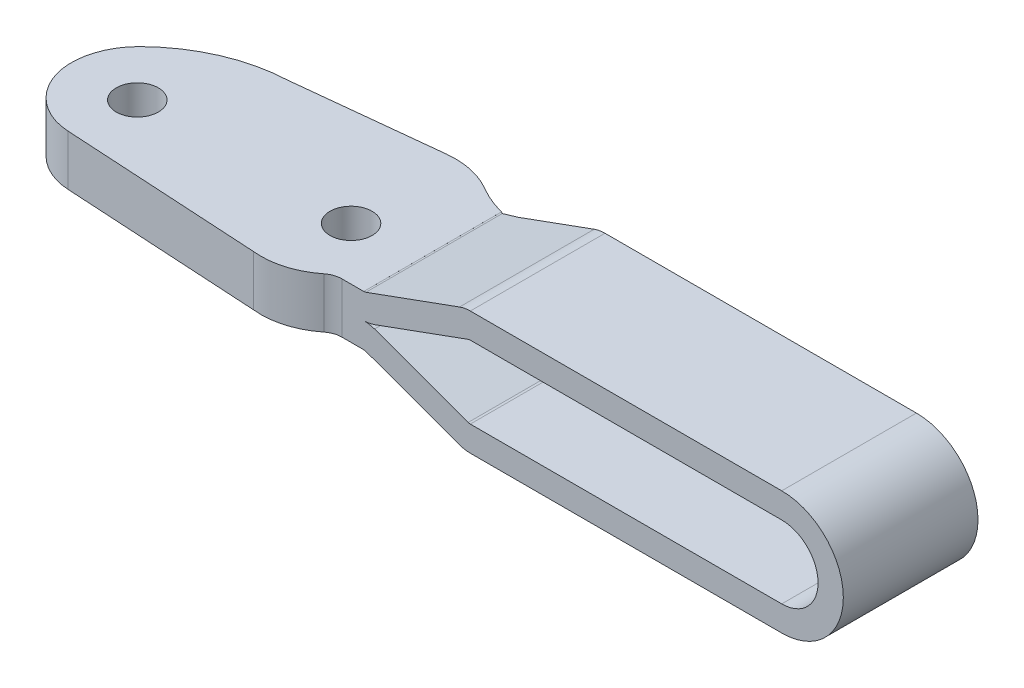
ISO-10303-21;
HEADER;
FILE_DESCRIPTION(('STEP AP214'),'2;1');
FILE_NAME('part.step','',(''),(''),'','','');
FILE_SCHEMA(('AUTOMOTIVE_DESIGN { 1 0 10303 214 1 1 1 1 }'));
ENDSEC;
DATA;
#1=APPLICATION_CONTEXT('core data for automotive mechanical design processes');
#2=APPLICATION_PROTOCOL_DEFINITION('international standard','automotive_design',2000,#1);
#3=PRODUCT_CONTEXT('',#1,'mechanical');
#4=PRODUCT('Part','Part','',(#3));
#5=PRODUCT_RELATED_PRODUCT_CATEGORY('part','',(#4));
#6=PRODUCT_DEFINITION_FORMATION('','',#4);
#7=PRODUCT_DEFINITION_CONTEXT('part definition',#1,'design');
#8=PRODUCT_DEFINITION('design','',#6,#7);
#9=PRODUCT_DEFINITION_SHAPE('','',#8);
#10=(LENGTH_UNIT() NAMED_UNIT(*) SI_UNIT(.MILLI.,.METRE.));
#11=(NAMED_UNIT(*) PLANE_ANGLE_UNIT() SI_UNIT($,.RADIAN.));
#12=(NAMED_UNIT(*) SI_UNIT($,.STERADIAN.) SOLID_ANGLE_UNIT());
#13=UNCERTAINTY_MEASURE_WITH_UNIT(LENGTH_MEASURE(1.E-05),#10,'distance_accuracy_value','');
#14=(GEOMETRIC_REPRESENTATION_CONTEXT(3) GLOBAL_UNCERTAINTY_ASSIGNED_CONTEXT((#13)) GLOBAL_UNIT_ASSIGNED_CONTEXT((#10,
#11,#12)) REPRESENTATION_CONTEXT('',''));
#15=CARTESIAN_POINT('',(0.,0.,0.));
#16=DIRECTION('',(0.,0.,1.));
#17=DIRECTION('',(1.,0.,0.));
#18=AXIS2_PLACEMENT_3D('',#15,#16,#17);
#19=CARTESIAN_POINT('',(33.1604534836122,-3.73599999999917,-15.));
#20=DIRECTION('',(0.,0.,1.));
#21=DIRECTION('',(1.,0.,0.));
#22=AXIS2_PLACEMENT_3D('',#19,#20,#21);
#23=CYLINDRICAL_SURFACE('',#22,3.74);
#24=CARTESIAN_POINT('',(33.1604534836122,-3.73599999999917,-10.120413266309));
#25=DIRECTION('',(0.553809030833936,0.,-0.832643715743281));
#26=DIRECTION('',(0.832643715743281,0.,0.553809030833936));
#27=AXIS2_PLACEMENT_3D('',#24,#25,#26);
#28=ELLIPSE('',#27,4.4917170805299,3.74);
#29=CARTESIAN_POINT('',(33.282729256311,0.00200062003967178,-10.0390850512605));
#30=VERTEX_POINT('',#29);
#31=CARTESIAN_POINT('',(33.4135104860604,-0.00457103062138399,-9.95209967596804));
#32=VERTEX_POINT('',#31);
#33=EDGE_CURVE('E24',#30,#32,#28,.T.);
#34=ORIENTED_EDGE('',*,*,#33,.F.);
#35=DIRECTION('',(0.,0.,1.));
#36=VECTOR('',#35,1.);
#37=CARTESIAN_POINT('',(33.282729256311,0.00200062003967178,-15.));
#38=LINE('',#37,#36);
#39=CARTESIAN_POINT('',(33.282729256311,0.00200062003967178,6.25079999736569));
#40=VERTEX_POINT('',#39);
#41=EDGE_CURVE('E370',#30,#40,#38,.T.);
#42=ORIENTED_EDGE('',*,*,#41,.T.);
#43=CARTESIAN_POINT('',(33.1604534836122,-3.73599999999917,6.25079999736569));
#44=DIRECTION('',(0.,0.,1.));
#45=DIRECTION('',(1.,0.,0.));
#46=AXIS2_PLACEMENT_3D('',#43,#44,#45);
#47=CIRCLE('',#46,3.74);
#48=CARTESIAN_POINT('',(34.4396088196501,-0.221549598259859,6.25079999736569));
#49=VERTEX_POINT('',#48);
#50=EDGE_CURVE('E400',#49,#40,#47,.T.);
#51=ORIENTED_EDGE('',*,*,#50,.F.);
#52=DIRECTION('',(0.,0.,1.));
#53=VECTOR('',#52,1.);
#54=CARTESIAN_POINT('',(34.4396088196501,-0.221549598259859,-15.));
#55=LINE('',#54,#53);
#56=CARTESIAN_POINT('',(34.4396088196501,-0.221549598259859,-9.85360277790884));
#57=VERTEX_POINT('',#56);
#58=EDGE_CURVE('E393',#57,#49,#55,.T.);
#59=ORIENTED_EDGE('',*,*,#58,.F.);
#60=CARTESIAN_POINT('',(33.1604534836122,-3.73599999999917,-9.9763910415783));
#61=DIRECTION('',(0.0955524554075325,0.,-0.995424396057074));
#62=DIRECTION('',(0.995424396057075,0.,0.0955524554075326));
#63=AXIS2_PLACEMENT_3D('',#60,#61,#62);
#64=ELLIPSE('',#63,3.75719141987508,3.74);
#65=EDGE_CURVE('E411',#32,#57,#64,.T.);
#66=ORIENTED_EDGE('',*,*,#65,.F.);
#67=EDGE_LOOP('',(#34,#42,#51,#59,#66));
#68=FACE_BOUND('',#67,.T.);
#69=ADVANCED_FACE('F14',(#68),#23,.T.);
#70=CARTESIAN_POINT('',(34.4396088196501,-0.221549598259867,-15.));
#71=DIRECTION('',(-0.342020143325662,-0.939692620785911,0.));
#72=DIRECTION('',(0.939692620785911,-0.342020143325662,0.));
#73=AXIS2_PLACEMENT_3D('',#70,#71,#72);
#74=PLANE('',#73);
#75=DIRECTION('',(0.93589287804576,-0.340637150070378,0.0898379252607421));
#76=VECTOR('',#75,1.);
#77=CARTESIAN_POINT('',(34.0069065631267,-0.0640588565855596,-9.89513859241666));
#78=LINE('',#77,#76);
#79=CARTESIAN_POINT('',(35.5063968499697,-0.609828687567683,-9.75120000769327));
#80=VERTEX_POINT('',#79);
#81=EDGE_CURVE('E456',#57,#80,#78,.T.);
#82=ORIENTED_EDGE('',*,*,#81,.F.);
#83=ORIENTED_EDGE('',*,*,#58,.T.);
#84=DIRECTION('',(-0.939692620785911,0.342020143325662,0.));
#85=VECTOR('',#84,1.);
#86=CARTESIAN_POINT('',(34.4396088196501,-0.221549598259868,6.25079999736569));
#87=LINE('',#86,#85);
#88=CARTESIAN_POINT('',(45.566405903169,-4.27137253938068,6.25079999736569));
#89=VERTEX_POINT('',#88);
#90=EDGE_CURVE('E310',#89,#49,#87,.T.);
#91=ORIENTED_EDGE('',*,*,#90,.F.);
#92=DIRECTION('',(0.,0.,1.));
#93=VECTOR('',#92,1.);
#94=CARTESIAN_POINT('',(45.566405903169,-4.27137253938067,-15.));
#95=LINE('',#94,#93);
#96=CARTESIAN_POINT('',(45.566405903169,-4.27137253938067,-9.75120000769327));
#97=VERTEX_POINT('',#96);
#98=EDGE_CURVE('E390',#97,#89,#95,.T.);
#99=ORIENTED_EDGE('',*,*,#98,.F.);
#100=DIRECTION('',(0.939692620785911,-0.342020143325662,0.));
#101=VECTOR('',#100,1.);
#102=CARTESIAN_POINT('',(34.4396088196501,-0.221549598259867,-9.75120000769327));
#103=LINE('',#102,#101);
#104=EDGE_CURVE('E9',#80,#97,#103,.T.);
#105=ORIENTED_EDGE('',*,*,#104,.F.);
#106=EDGE_LOOP('',(#82,#83,#91,#99,#105));
#107=FACE_BOUND('',#106,.T.);
#108=ADVANCED_FACE('F542',(#107),#74,.F.);
#109=CARTESIAN_POINT('',(45.81950080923,-3.57599999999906,-15.));
#110=DIRECTION('',(0.,0.,1.));
#111=DIRECTION('',(1.,0.,0.));
#112=AXIS2_PLACEMENT_3D('',#109,#110,#111);
#113=CYLINDRICAL_SURFACE('',#112,0.740000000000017);
#114=CARTESIAN_POINT('',(45.81950080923,-3.57599999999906,-9.75120000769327));
#115=DIRECTION('',(0.,0.,-1.));
#116=DIRECTION('',(-1.,0.,0.));
#117=AXIS2_PLACEMENT_3D('',#114,#115,#116);
#118=CIRCLE('',#117,0.740000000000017);
#119=CARTESIAN_POINT('',(45.81950080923,-4.31599999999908,-9.75120000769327));
#120=VERTEX_POINT('',#119);
#121=EDGE_CURVE('E335',#97,#120,#118,.F.);
#122=ORIENTED_EDGE('',*,*,#121,.F.);
#123=ORIENTED_EDGE('',*,*,#98,.T.);
#124=CARTESIAN_POINT('',(45.81950080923,-3.57599999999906,6.25079999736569));
#125=DIRECTION('',(0.,0.,1.));
#126=DIRECTION('',(1.,0.,0.));
#127=AXIS2_PLACEMENT_3D('',#124,#125,#126);
#128=CIRCLE('',#127,0.740000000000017);
#129=CARTESIAN_POINT('',(45.81950080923,-4.31599999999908,6.25079999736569));
#130=VERTEX_POINT('',#129);
#131=EDGE_CURVE('E496',#130,#89,#128,.F.);
#132=ORIENTED_EDGE('',*,*,#131,.F.);
#133=DIRECTION('',(0.,0.,1.));
#134=VECTOR('',#133,1.);
#135=CARTESIAN_POINT('',(45.81950080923,-4.31599999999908,-15.));
#136=LINE('',#135,#134);
#137=EDGE_CURVE('E387',#120,#130,#136,.T.);
#138=ORIENTED_EDGE('',*,*,#137,.F.);
#139=EDGE_LOOP('',(#122,#123,#132,#138));
#140=FACE_BOUND('',#139,.T.);
#141=ADVANCED_FACE('F582',(#140),#113,.F.);
#142=CARTESIAN_POINT('',(45.81950080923,-4.31599999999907,-15.));
#143=DIRECTION('',(0.,-1.,0.));
#144=DIRECTION('',(1.,0.,0.));
#145=AXIS2_PLACEMENT_3D('',#142,#143,#144);
#146=PLANE('',#145);
#147=DIRECTION('',(1.,0.,0.));
#148=VECTOR('',#147,1.);
#149=CARTESIAN_POINT('',(45.81950080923,-4.31599999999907,-9.75120000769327));
#150=LINE('',#149,#148);
#151=CARTESIAN_POINT('',(82.8214948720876,-4.31599999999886,-9.75120000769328));
#152=VERTEX_POINT('',#151);
#153=EDGE_CURVE('E339',#120,#152,#150,.T.);
#154=ORIENTED_EDGE('',*,*,#153,.F.);
#155=ORIENTED_EDGE('',*,*,#137,.T.);
#156=DIRECTION('',(-1.,0.,0.));
#157=VECTOR('',#156,1.);
#158=CARTESIAN_POINT('',(45.81950080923,-4.31599999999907,6.25079999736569));
#159=LINE('',#158,#157);
#160=CARTESIAN_POINT('',(82.8214948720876,-4.31599999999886,6.25079999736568));
#161=VERTEX_POINT('',#160);
#162=EDGE_CURVE('E498',#161,#130,#159,.T.);
#163=ORIENTED_EDGE('',*,*,#162,.F.);
#164=DIRECTION('',(0.,0.,1.));
#165=VECTOR('',#164,1.);
#166=CARTESIAN_POINT('',(82.8214948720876,-4.31599999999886,-15.));
#167=LINE('',#166,#165);
#168=EDGE_CURVE('E384',#152,#161,#167,.T.);
#169=ORIENTED_EDGE('',*,*,#168,.F.);
#170=EDGE_LOOP('',(#154,#155,#163,#169));
#171=FACE_BOUND('',#170,.T.);
#172=ADVANCED_FACE('F577',(#171),#146,.F.);
#173=CARTESIAN_POINT('',(82.8214948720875,0.00200000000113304,-15.));
#174=DIRECTION('',(0.,0.,1.));
#175=DIRECTION('',(1.,0.,0.));
#176=AXIS2_PLACEMENT_3D('',#173,#174,#175);
#177=CYLINDRICAL_SURFACE('',#176,4.318);
#178=CARTESIAN_POINT('',(82.8214948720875,0.00200000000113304,-9.75120000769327));
#179=DIRECTION('',(0.,0.,-1.));
#180=DIRECTION('',(-1.,0.,0.));
#181=AXIS2_PLACEMENT_3D('',#178,#179,#180);
#182=CIRCLE('',#181,4.318);
#183=CARTESIAN_POINT('',(82.8214948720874,4.32000000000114,-9.75120000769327));
#184=VERTEX_POINT('',#183);
#185=EDGE_CURVE('E341',#152,#184,#182,.F.);
#186=ORIENTED_EDGE('',*,*,#185,.F.);
#187=ORIENTED_EDGE('',*,*,#168,.T.);
#188=CARTESIAN_POINT('',(82.8214948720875,0.00200000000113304,6.25079999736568));
#189=DIRECTION('',(0.,0.,1.));
#190=DIRECTION('',(1.,0.,0.));
#191=AXIS2_PLACEMENT_3D('',#188,#189,#190);
#192=CIRCLE('',#191,4.318);
#193=CARTESIAN_POINT('',(82.8214948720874,4.32000000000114,6.25079999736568));
#194=VERTEX_POINT('',#193);
#195=EDGE_CURVE('E500',#194,#161,#192,.F.);
#196=ORIENTED_EDGE('',*,*,#195,.F.);
#197=DIRECTION('',(0.,0.,1.));
#198=VECTOR('',#197,1.);
#199=CARTESIAN_POINT('',(82.8214948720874,4.32000000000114,-15.));
#200=LINE('',#199,#198);
#201=EDGE_CURVE('E381',#184,#194,#200,.T.);
#202=ORIENTED_EDGE('',*,*,#201,.F.);
#203=EDGE_LOOP('',(#186,#187,#196,#202));
#204=FACE_BOUND('',#203,.T.);
#205=ADVANCED_FACE('F573',(#204),#177,.F.);
#206=CARTESIAN_POINT('',(82.8214948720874,4.32000000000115,-15.));
#207=DIRECTION('',(0.,1.,0.));
#208=DIRECTION('',(-1.,0.,0.));
#209=AXIS2_PLACEMENT_3D('',#206,#207,#208);
#210=PLANE('',#209);
#211=DIRECTION('',(-1.,0.,0.));
#212=VECTOR('',#211,1.);
#213=CARTESIAN_POINT('',(82.8214948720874,4.32000000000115,-9.75120000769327));
#214=LINE('',#213,#212);
#215=CARTESIAN_POINT('',(45.8194629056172,4.32000000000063,-9.75120000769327));
#216=VERTEX_POINT('',#215);
#217=EDGE_CURVE('E343',#184,#216,#214,.T.);
#218=ORIENTED_EDGE('',*,*,#217,.F.);
#219=ORIENTED_EDGE('',*,*,#201,.T.);
#220=DIRECTION('',(1.,0.,0.));
#221=VECTOR('',#220,1.);
#222=CARTESIAN_POINT('',(82.8214948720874,4.32000000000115,6.25079999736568));
#223=LINE('',#222,#221);
#224=CARTESIAN_POINT('',(45.8194629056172,4.32000000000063,6.25079999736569));
#225=VERTEX_POINT('',#224);
#226=EDGE_CURVE('E502',#225,#194,#223,.T.);
#227=ORIENTED_EDGE('',*,*,#226,.F.);
#228=DIRECTION('',(0.,0.,1.));
#229=VECTOR('',#228,1.);
#230=CARTESIAN_POINT('',(45.8194629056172,4.32000000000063,-15.));
#231=LINE('',#230,#229);
#232=EDGE_CURVE('E378',#216,#225,#231,.T.);
#233=ORIENTED_EDGE('',*,*,#232,.F.);
#234=EDGE_LOOP('',(#218,#219,#227,#233));
#235=FACE_BOUND('',#234,.T.);
#236=ADVANCED_FACE('F567',(#235),#210,.F.);
#237=CARTESIAN_POINT('',(45.8194629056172,3.58000000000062,-15.));
#238=DIRECTION('',(0.,0.,1.));
#239=DIRECTION('',(1.,0.,0.));
#240=AXIS2_PLACEMENT_3D('',#237,#238,#239);
#241=CYLINDRICAL_SURFACE('',#240,0.739999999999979);
#242=CARTESIAN_POINT('',(45.8194629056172,3.58000000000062,-9.75120000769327));
#243=DIRECTION('',(0.,0.,-1.));
#244=DIRECTION('',(-1.,0.,0.));
#245=AXIS2_PLACEMENT_3D('',#242,#243,#244);
#246=CIRCLE('',#245,0.739999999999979);
#247=CARTESIAN_POINT('',(45.5663679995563,4.27537253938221,-9.75120000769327));
#248=VERTEX_POINT('',#247);
#249=EDGE_CURVE('E345',#216,#248,#246,.F.);
#250=ORIENTED_EDGE('',*,*,#249,.F.);
#251=ORIENTED_EDGE('',*,*,#232,.T.);
#252=CARTESIAN_POINT('',(45.8194629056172,3.58000000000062,6.25079999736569));
#253=DIRECTION('',(0.,0.,1.));
#254=DIRECTION('',(1.,0.,0.));
#255=AXIS2_PLACEMENT_3D('',#252,#253,#254);
#256=CIRCLE('',#255,0.739999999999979);
#257=CARTESIAN_POINT('',(45.5663679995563,4.27537253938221,6.25079999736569));
#258=VERTEX_POINT('',#257);
#259=EDGE_CURVE('E504',#258,#225,#256,.F.);
#260=ORIENTED_EDGE('',*,*,#259,.F.);
#261=DIRECTION('',(0.,0.,1.));
#262=VECTOR('',#261,1.);
#263=CARTESIAN_POINT('',(45.5663679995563,4.27537253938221,-15.));
#264=LINE('',#263,#262);
#265=EDGE_CURVE('E375',#248,#258,#264,.T.);
#266=ORIENTED_EDGE('',*,*,#265,.F.);
#267=EDGE_LOOP('',(#250,#251,#260,#266));
#268=FACE_BOUND('',#267,.T.);
#269=ADVANCED_FACE('F563',(#268),#241,.F.);
#270=CARTESIAN_POINT('',(45.5663679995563,4.27537253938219,-15.));
#271=DIRECTION('',(-0.342020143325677,0.939692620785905,0.));
#272=DIRECTION('',(-0.939692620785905,-0.342020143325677,0.));
#273=AXIS2_PLACEMENT_3D('',#270,#271,#272);
#274=PLANE('',#273);
#275=DIRECTION('',(-0.935892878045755,-0.340637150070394,-0.0898379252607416));
#276=VECTOR('',#275,1.);
#277=CARTESIAN_POINT('',(45.0438633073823,4.08519638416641,-8.83568262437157));
#278=LINE('',#277,#276);
#279=CARTESIAN_POINT('',(35.5063968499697,0.613842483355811,-9.75120000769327));
#280=VERTEX_POINT('',#279);
#281=CARTESIAN_POINT('',(34.4395709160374,0.225549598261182,-9.85360641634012));
#282=VERTEX_POINT('',#281);
#283=EDGE_CURVE('E466',#280,#282,#278,.T.);
#284=ORIENTED_EDGE('',*,*,#283,.F.);
#285=DIRECTION('',(-0.939692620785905,-0.342020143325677,0.));
#286=VECTOR('',#285,1.);
#287=CARTESIAN_POINT('',(45.5663679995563,4.27537253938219,-9.75120000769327));
#288=LINE('',#287,#286);
#289=EDGE_CURVE('E347',#248,#280,#288,.T.);
#290=ORIENTED_EDGE('',*,*,#289,.F.);
#291=ORIENTED_EDGE('',*,*,#265,.T.);
#292=DIRECTION('',(0.939692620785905,0.342020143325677,0.));
#293=VECTOR('',#292,1.);
#294=CARTESIAN_POINT('',(45.5663679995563,4.27537253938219,6.25079999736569));
#295=LINE('',#294,#293);
#296=CARTESIAN_POINT('',(34.4395709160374,0.225549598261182,6.25079999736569));
#297=VERTEX_POINT('',#296);
#298=EDGE_CURVE('E506',#297,#258,#295,.T.);
#299=ORIENTED_EDGE('',*,*,#298,.F.);
#300=DIRECTION('',(0.,0.,1.));
#301=VECTOR('',#300,1.);
#302=CARTESIAN_POINT('',(34.4395709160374,0.225549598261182,-15.));
#303=LINE('',#302,#301);
#304=EDGE_CURVE('E371',#282,#297,#303,.T.);
#305=ORIENTED_EDGE('',*,*,#304,.F.);
#306=EDGE_LOOP('',(#284,#290,#291,#299,#305));
#307=FACE_BOUND('',#306,.T.);
#308=ADVANCED_FACE('F557',(#307),#274,.F.);
#309=CARTESIAN_POINT('',(33.1604155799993,3.74000000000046,-15.));
#310=DIRECTION('',(0.,0.,1.));
#311=DIRECTION('',(1.,0.,0.));
#312=AXIS2_PLACEMENT_3D('',#309,#310,#311);
#313=CYLINDRICAL_SURFACE('',#312,3.74);
#314=CARTESIAN_POINT('',(33.1604155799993,3.74000000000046,-10.1204384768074));
#315=DIRECTION('',(0.553809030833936,0.,-0.832643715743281));
#316=DIRECTION('',(0.832643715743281,0.,0.553809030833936));
#317=AXIS2_PLACEMENT_3D('',#314,#315,#316);
#318=ELLIPSE('',#317,4.49171708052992,3.74);
#319=CARTESIAN_POINT('',(33.4135104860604,0.00857360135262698,-9.95209967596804));
#320=VERTEX_POINT('',#319);
#321=EDGE_CURVE('E326',#320,#30,#318,.T.);
#322=ORIENTED_EDGE('',*,*,#321,.F.);
#323=CARTESIAN_POINT('',(33.1604155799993,3.74000000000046,-9.9763946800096));
#324=DIRECTION('',(0.0955524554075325,0.,-0.995424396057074));
#325=DIRECTION('',(0.995424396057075,0.,0.0955524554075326));
#326=AXIS2_PLACEMENT_3D('',#323,#324,#325);
#327=ELLIPSE('',#326,3.7571914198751,3.74);
#328=EDGE_CURVE('E468',#282,#320,#327,.T.);
#329=ORIENTED_EDGE('',*,*,#328,.F.);
#330=ORIENTED_EDGE('',*,*,#304,.T.);
#331=CARTESIAN_POINT('',(33.1604155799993,3.74000000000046,6.25079999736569));
#332=DIRECTION('',(0.,0.,1.));
#333=DIRECTION('',(1.,0.,0.));
#334=AXIS2_PLACEMENT_3D('',#331,#332,#333);
#335=CIRCLE('',#334,3.74);
#336=EDGE_CURVE('E508',#40,#297,#335,.T.);
#337=ORIENTED_EDGE('',*,*,#336,.F.);
#338=ORIENTED_EDGE('',*,*,#41,.F.);
#339=EDGE_LOOP('',(#322,#329,#330,#337,#338));
#340=FACE_BOUND('',#339,.T.);
#341=ADVANCED_FACE('F553',(#340),#313,.T.);
#342=CARTESIAN_POINT('',(92.8949504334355,-15.,-9.75120000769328));
#343=DIRECTION('',(0.,0.,-1.));
#344=DIRECTION('',(-1.,0.,0.));
#345=AXIS2_PLACEMENT_3D('',#342,#343,#344);
#346=PLANE('',#345);
#347=DIRECTION('',(0.,1.,0.));
#348=VECTOR('',#347,1.);
#349=CARTESIAN_POINT('',(35.5063968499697,-15.,-9.75120000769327));
#350=LINE('',#349,#348);
#351=CARTESIAN_POINT('',(35.5063968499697,-3.80236200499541,-9.75120000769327));
#352=VERTEX_POINT('',#351);
#353=EDGE_CURVE('E464',#352,#80,#350,.T.);
#354=ORIENTED_EDGE('',*,*,#353,.T.);
#355=ORIENTED_EDGE('',*,*,#104,.T.);
#356=ORIENTED_EDGE('',*,*,#121,.T.);
#357=ORIENTED_EDGE('',*,*,#153,.T.);
#358=ORIENTED_EDGE('',*,*,#185,.T.);
#359=ORIENTED_EDGE('',*,*,#217,.T.);
#360=ORIENTED_EDGE('',*,*,#249,.T.);
#361=ORIENTED_EDGE('',*,*,#289,.T.);
#362=CARTESIAN_POINT('',(35.5063968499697,3.80637580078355,-9.75120000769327));
#363=VERTEX_POINT('',#362);
#364=EDGE_CURVE('E477',#280,#363,#350,.T.);
#365=ORIENTED_EDGE('',*,*,#364,.T.);
#366=DIRECTION('',(-0.939692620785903,-0.342020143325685,0.));
#367=VECTOR('',#366,1.);
#368=CARTESIAN_POINT('',(44.540307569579,7.0944504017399,-9.75120000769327));
#369=LINE('',#368,#367);
#370=CARTESIAN_POINT('',(44.540307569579,7.09445040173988,-9.75120000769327));
#371=VERTEX_POINT('',#370);
#372=EDGE_CURVE('E361',#371,#363,#369,.T.);
#373=ORIENTED_EDGE('',*,*,#372,.F.);
#374=CARTESIAN_POINT('',(45.8194629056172,3.58000000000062,-9.75120000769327));
#375=DIRECTION('',(0.,0.,-1.));
#376=DIRECTION('',(-1.,0.,0.));
#377=AXIS2_PLACEMENT_3D('',#374,#375,#376);
#378=CIRCLE('',#377,3.74);
#379=CARTESIAN_POINT('',(45.8194629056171,7.32000000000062,-9.75120000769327));
#380=VERTEX_POINT('',#379);
#381=EDGE_CURVE('E358',#380,#371,#378,.F.);
#382=ORIENTED_EDGE('',*,*,#381,.F.);
#383=DIRECTION('',(-1.,0.,0.));
#384=VECTOR('',#383,1.);
#385=CARTESIAN_POINT('',(82.8214948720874,7.32000000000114,-9.75120000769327));
#386=LINE('',#385,#384);
#387=CARTESIAN_POINT('',(82.8214948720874,7.32000000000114,-9.75120000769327));
#388=VERTEX_POINT('',#387);
#389=EDGE_CURVE('E355',#388,#380,#386,.T.);
#390=ORIENTED_EDGE('',*,*,#389,.F.);
#391=CARTESIAN_POINT('',(82.8214948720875,0.00200000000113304,-9.75120000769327));
#392=DIRECTION('',(0.,0.,-1.));
#393=DIRECTION('',(-1.,0.,0.));
#394=AXIS2_PLACEMENT_3D('',#391,#392,#393);
#395=CIRCLE('',#394,7.318);
#396=CARTESIAN_POINT('',(82.8214948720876,-7.31599999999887,-9.75120000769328));
#397=VERTEX_POINT('',#396);
#398=EDGE_CURVE('E352',#397,#388,#395,.F.);
#399=ORIENTED_EDGE('',*,*,#398,.F.);
#400=DIRECTION('',(1.,0.,0.));
#401=VECTOR('',#400,1.);
#402=CARTESIAN_POINT('',(45.81950080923,-7.31599999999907,-9.75120000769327));
#403=LINE('',#402,#401);
#404=CARTESIAN_POINT('',(45.81950080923,-7.31599999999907,-9.75120000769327));
#405=VERTEX_POINT('',#404);
#406=EDGE_CURVE('E349',#405,#397,#403,.T.);
#407=ORIENTED_EDGE('',*,*,#406,.F.);
#408=CARTESIAN_POINT('',(45.81950080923,-3.57599999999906,-9.75120000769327));
#409=DIRECTION('',(0.,0.,-1.));
#410=DIRECTION('',(-1.,0.,0.));
#411=AXIS2_PLACEMENT_3D('',#408,#409,#410);
#412=CIRCLE('',#411,3.74);
#413=CARTESIAN_POINT('',(44.540345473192,-7.09045040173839,-9.75120000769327));
#414=VERTEX_POINT('',#413);
#415=EDGE_CURVE('E364',#414,#405,#412,.F.);
#416=ORIENTED_EDGE('',*,*,#415,.F.);
#417=DIRECTION('',(0.939692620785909,-0.342020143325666,0.));
#418=VECTOR('',#417,1.);
#419=CARTESIAN_POINT('',(33.413548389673,-3.04062746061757,-9.75120000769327));
#420=LINE('',#419,#418);
#421=EDGE_CURVE('E367',#352,#414,#420,.T.);
#422=ORIENTED_EDGE('',*,*,#421,.F.);
#423=EDGE_LOOP('',(#354,#355,#356,#357,#358,#359,#360,#361,#365,#373,#382,#390,#399,#407,#416,#422));
#424=FACE_BOUND('',#423,.T.);
#425=ADVANCED_FACE('F481',(#424),#346,.T.);
#426=CARTESIAN_POINT('',(33.1604155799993,-15.,-10.1204384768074));
#427=DIRECTION('',(0.553809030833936,0.,-0.832643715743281));
#428=DIRECTION('',(-0.832643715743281,0.,-0.553809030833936));
#429=AXIS2_PLACEMENT_3D('',#426,#427,#428);
#430=PLANE('',#429);
#431=DIRECTION('',(0.,1.,0.));
#432=VECTOR('',#431,1.);
#433=CARTESIAN_POINT('',(33.1604155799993,-15.,-10.1204384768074));
#434=LINE('',#433,#432);
#435=CARTESIAN_POINT('',(33.1604369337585,-2.99599999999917,-10.1204335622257));
#436=VERTEX_POINT('',#435);
#437=CARTESIAN_POINT('',(33.1604155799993,3.00000000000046,-10.1204384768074));
#438=VERTEX_POINT('',#437);
#439=EDGE_CURVE('E315',#436,#438,#434,.T.);
#440=ORIENTED_EDGE('',*,*,#439,.T.);
#441=CARTESIAN_POINT('',(33.1604155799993,3.74000000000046,-10.1204384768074));
#442=DIRECTION('',(0.553809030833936,0.,-0.832643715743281));
#443=DIRECTION('',(0.832643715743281,0.,0.553809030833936));
#444=AXIS2_PLACEMENT_3D('',#441,#442,#443);
#445=ELLIPSE('',#444,0.888735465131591,0.74);
#446=CARTESIAN_POINT('',(33.4135104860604,3.04462746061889,-9.95209967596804));
#447=VERTEX_POINT('',#446);
#448=EDGE_CURVE('E328',#447,#438,#445,.T.);
#449=ORIENTED_EDGE('',*,*,#448,.F.);
#450=DIRECTION('',(0.,1.,0.));
#451=VECTOR('',#450,1.);
#452=CARTESIAN_POINT('',(33.4135104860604,-15.,-9.95209967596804));
#453=LINE('',#452,#451);
#454=EDGE_CURVE('E462',#320,#447,#453,.T.);
#455=ORIENTED_EDGE('',*,*,#454,.F.);
#456=ORIENTED_EDGE('',*,*,#321,.T.);
#457=ORIENTED_EDGE('',*,*,#33,.T.);
#458=CARTESIAN_POINT('',(33.4135389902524,-3.04062403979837,-9.95209965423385));
#459=VERTEX_POINT('',#458);
#460=EDGE_CURVE('E40',#459,#32,#453,.T.);
#461=ORIENTED_EDGE('',*,*,#460,.F.);
#462=CARTESIAN_POINT('',(33.160453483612,-3.73599999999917,-10.1204132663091));
#463=DIRECTION('',(0.553809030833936,0.,-0.832643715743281));
#464=DIRECTION('',(0.832643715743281,0.,0.553809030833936));
#465=AXIS2_PLACEMENT_3D('',#462,#463,#464);
#466=ELLIPSE('',#465,0.888735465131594,0.74);
#467=EDGE_CURVE('E332',#436,#459,#466,.T.);
#468=ORIENTED_EDGE('',*,*,#467,.F.);
#469=EDGE_LOOP('',(#440,#449,#455,#456,#457,#461,#468));
#470=FACE_BOUND('',#469,.T.);
#471=ADVANCED_FACE('F441',(#470),#430,.T.);
#472=CARTESIAN_POINT('',(33.4135104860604,-15.,-9.95209967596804));
#473=DIRECTION('',(0.0955524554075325,0.,-0.995424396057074));
#474=DIRECTION('',(-0.995424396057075,0.,-0.0955524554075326));
#475=AXIS2_PLACEMENT_3D('',#472,#473,#474);
#476=PLANE('',#475);
#477=ORIENTED_EDGE('',*,*,#364,.F.);
#478=ORIENTED_EDGE('',*,*,#283,.T.);
#479=ORIENTED_EDGE('',*,*,#328,.T.);
#480=ORIENTED_EDGE('',*,*,#454,.T.);
#481=DIRECTION('',(-0.935892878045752,-0.340637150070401,-0.0898379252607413));
#482=VECTOR('',#481,1.);
#483=CARTESIAN_POINT('',(44.0260840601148,6.90728835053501,-8.93338095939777));
#484=LINE('',#483,#482);
#485=EDGE_CURVE('E470',#363,#447,#484,.T.);
#486=ORIENTED_EDGE('',*,*,#485,.F.);
#487=EDGE_LOOP('',(#477,#478,#479,#480,#486));
#488=FACE_BOUND('',#487,.T.);
#489=ADVANCED_FACE('F476',(#488),#476,.T.);
#490=ORIENTED_EDGE('',*,*,#460,.T.);
#491=ORIENTED_EDGE('',*,*,#65,.T.);
#492=ORIENTED_EDGE('',*,*,#81,.T.);
#493=ORIENTED_EDGE('',*,*,#353,.F.);
#494=DIRECTION('',(0.935892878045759,-0.340637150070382,0.0898379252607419));
#495=VECTOR('',#494,1.);
#496=CARTESIAN_POINT('',(32.9891273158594,-2.88615082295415,-9.99283692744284));
#497=LINE('',#496,#495);
#498=EDGE_CURVE('E329',#459,#352,#497,.T.);
#499=ORIENTED_EDGE('',*,*,#498,.F.);
#500=EDGE_LOOP('',(#490,#491,#492,#493,#499));
#501=FACE_BOUND('',#500,.T.);
#502=ADVANCED_FACE('F537',(#501),#476,.T.);
#503=CARTESIAN_POINT('',(92.8949504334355,-15.,6.25079999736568));
#504=DIRECTION('',(0.,0.,1.));
#505=DIRECTION('',(1.,0.,0.));
#506=AXIS2_PLACEMENT_3D('',#503,#504,#505);
#507=PLANE('',#506);
#508=CARTESIAN_POINT('',(33.160453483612,-3.73599999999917,6.25079999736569));
#509=DIRECTION('',(0.,0.,1.));
#510=DIRECTION('',(1.,0.,0.));
#511=AXIS2_PLACEMENT_3D('',#508,#509,#510);
#512=CIRCLE('',#511,0.74);
#513=CARTESIAN_POINT('',(33.413548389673,-3.04062746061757,6.25079999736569));
#514=VERTEX_POINT('',#513);
#515=CARTESIAN_POINT('',(33.1604534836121,-2.99599999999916,6.25079999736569));
#516=VERTEX_POINT('',#515);
#517=EDGE_CURVE('E454',#514,#516,#512,.T.);
#518=ORIENTED_EDGE('',*,*,#517,.F.);
#519=DIRECTION('',(-0.939692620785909,0.342020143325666,0.));
#520=VECTOR('',#519,1.);
#521=CARTESIAN_POINT('',(33.413548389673,-3.04062746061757,6.25079999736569));
#522=LINE('',#521,#520);
#523=CARTESIAN_POINT('',(44.540345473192,-7.09045040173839,6.25079999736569));
#524=VERTEX_POINT('',#523);
#525=EDGE_CURVE('E452',#524,#514,#522,.T.);
#526=ORIENTED_EDGE('',*,*,#525,.F.);
#527=CARTESIAN_POINT('',(45.81950080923,-3.57599999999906,6.25079999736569));
#528=DIRECTION('',(0.,0.,1.));
#529=DIRECTION('',(1.,0.,0.));
#530=AXIS2_PLACEMENT_3D('',#527,#528,#529);
#531=CIRCLE('',#530,3.74);
#532=CARTESIAN_POINT('',(45.81950080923,-7.31599999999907,6.25079999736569));
#533=VERTEX_POINT('',#532);
#534=EDGE_CURVE('E32',#533,#524,#531,.F.);
#535=ORIENTED_EDGE('',*,*,#534,.F.);
#536=DIRECTION('',(-1.,0.,0.));
#537=VECTOR('',#536,1.);
#538=CARTESIAN_POINT('',(45.81950080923,-7.31599999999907,6.25079999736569));
#539=LINE('',#538,#537);
#540=CARTESIAN_POINT('',(82.8214948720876,-7.31599999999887,6.25079999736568));
#541=VERTEX_POINT('',#540);
#542=EDGE_CURVE('E510',#541,#533,#539,.T.);
#543=ORIENTED_EDGE('',*,*,#542,.F.);
#544=CARTESIAN_POINT('',(82.8214948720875,0.00200000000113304,6.25079999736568));
#545=DIRECTION('',(0.,0.,1.));
#546=DIRECTION('',(1.,0.,0.));
#547=AXIS2_PLACEMENT_3D('',#544,#545,#546);
#548=CIRCLE('',#547,7.318);
#549=CARTESIAN_POINT('',(82.8214948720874,7.32000000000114,6.25079999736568));
#550=VERTEX_POINT('',#549);
#551=EDGE_CURVE('E512',#550,#541,#548,.F.);
#552=ORIENTED_EDGE('',*,*,#551,.F.);
#553=DIRECTION('',(1.,0.,0.));
#554=VECTOR('',#553,1.);
#555=CARTESIAN_POINT('',(82.8214948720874,7.32000000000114,6.25079999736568));
#556=LINE('',#555,#554);
#557=CARTESIAN_POINT('',(45.8194629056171,7.32000000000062,6.25079999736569));
#558=VERTEX_POINT('',#557);
#559=EDGE_CURVE('E515',#558,#550,#556,.T.);
#560=ORIENTED_EDGE('',*,*,#559,.F.);
#561=CARTESIAN_POINT('',(45.8194629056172,3.58000000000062,6.25079999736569));
#562=DIRECTION('',(0.,0.,1.));
#563=DIRECTION('',(1.,0.,0.));
#564=AXIS2_PLACEMENT_3D('',#561,#562,#563);
#565=CIRCLE('',#564,3.74);
#566=CARTESIAN_POINT('',(44.540307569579,7.09445040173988,6.25079999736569));
#567=VERTEX_POINT('',#566);
#568=EDGE_CURVE('E518',#567,#558,#565,.F.);
#569=ORIENTED_EDGE('',*,*,#568,.F.);
#570=DIRECTION('',(0.939692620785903,0.342020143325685,0.));
#571=VECTOR('',#570,1.);
#572=CARTESIAN_POINT('',(44.540307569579,7.0944504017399,6.25079999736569));
#573=LINE('',#572,#571);
#574=CARTESIAN_POINT('',(33.4135104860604,3.04462746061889,6.25079999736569));
#575=VERTEX_POINT('',#574);
#576=EDGE_CURVE('E521',#575,#567,#573,.T.);
#577=ORIENTED_EDGE('',*,*,#576,.F.);
#578=CARTESIAN_POINT('',(33.1604155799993,3.74000000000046,6.25079999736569));
#579=DIRECTION('',(0.,0.,1.));
#580=DIRECTION('',(1.,0.,0.));
#581=AXIS2_PLACEMENT_3D('',#578,#579,#580);
#582=CIRCLE('',#581,0.74);
#583=CARTESIAN_POINT('',(33.1604155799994,3.00000000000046,6.25079999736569));
#584=VERTEX_POINT('',#583);
#585=EDGE_CURVE('E256',#584,#575,#582,.T.);
#586=ORIENTED_EDGE('',*,*,#585,.F.);
#587=DIRECTION('',(0.,-1.,0.));
#588=VECTOR('',#587,1.);
#589=CARTESIAN_POINT('',(33.1604155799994,3.00200000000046,6.25079999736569));
#590=LINE('',#589,#588);
#591=CARTESIAN_POINT('',(33.1604155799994,3.00200000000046,6.25079999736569));
#592=VERTEX_POINT('',#591);
#593=EDGE_CURVE('E234',#592,#584,#590,.T.);
#594=ORIENTED_EDGE('',*,*,#593,.F.);
#595=DIRECTION('',(1.,0.,0.));
#596=VECTOR('',#595,1.);
#597=CARTESIAN_POINT('',(30.5513398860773,3.00200000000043,6.25079999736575));
#598=LINE('',#597,#596);
#599=CARTESIAN_POINT('',(30.5513398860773,3.00200000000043,6.25079999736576));
#600=VERTEX_POINT('',#599);
#601=EDGE_CURVE('E242',#600,#592,#598,.T.);
#602=ORIENTED_EDGE('',*,*,#601,.F.);
#603=DIRECTION('',(0.,1.,0.));
#604=VECTOR('',#603,1.);
#605=CARTESIAN_POINT('',(30.5513398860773,-15.,6.25079999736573));
#606=LINE('',#605,#604);
#607=CARTESIAN_POINT('',(30.5513398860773,-2.99799999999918,6.25079999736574));
#608=VERTEX_POINT('',#607);
#609=EDGE_CURVE('E483',#608,#600,#606,.T.);
#610=ORIENTED_EDGE('',*,*,#609,.F.);
#611=DIRECTION('',(-1.,0.,0.));
#612=VECTOR('',#611,1.);
#613=CARTESIAN_POINT('',(33.1604534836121,-2.99799999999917,6.25079999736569));
#614=LINE('',#613,#612);
#615=CARTESIAN_POINT('',(33.1604534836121,-2.99799999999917,6.25079999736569));
#616=VERTEX_POINT('',#615);
#617=EDGE_CURVE('E275',#616,#608,#614,.T.);
#618=ORIENTED_EDGE('',*,*,#617,.F.);
#619=DIRECTION('',(0.,1.,0.));
#620=VECTOR('',#619,1.);
#621=CARTESIAN_POINT('',(33.1604534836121,-2.99799999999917,6.25079999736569));
#622=LINE('',#621,#620);
#623=EDGE_CURVE('E299',#616,#516,#622,.T.);
#624=ORIENTED_EDGE('',*,*,#623,.T.);
#625=EDGE_LOOP('',(#518,#526,#535,#543,#552,#560,#569,#577,#586,#594,#602,#610,#618,#624));
#626=FACE_BOUND('',#625,.T.);
#627=ORIENTED_EDGE('',*,*,#336,.T.);
#628=ORIENTED_EDGE('',*,*,#298,.T.);
#629=ORIENTED_EDGE('',*,*,#259,.T.);
#630=ORIENTED_EDGE('',*,*,#226,.T.);
#631=ORIENTED_EDGE('',*,*,#195,.T.);
#632=ORIENTED_EDGE('',*,*,#162,.T.);
#633=ORIENTED_EDGE('',*,*,#131,.T.);
#634=ORIENTED_EDGE('',*,*,#90,.T.);
#635=ORIENTED_EDGE('',*,*,#50,.T.);
#636=EDGE_LOOP('',(#627,#628,#629,#630,#631,#632,#633,#634,#635));
#637=FACE_BOUND('',#636,.T.);
#638=ADVANCED_FACE('F253',(#626,#637),#507,.T.);
#639=CARTESIAN_POINT('',(7.69309652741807,-15.,7.56645071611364));
#640=DIRECTION('',(0.,1.,0.));
#641=DIRECTION('',(0.,0.,1.));
#642=AXIS2_PLACEMENT_3D('',#639,#640,#641);
#643=CYLINDRICAL_SURFACE('',#642,18.554922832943);
#644=DIRECTION('',(0.,1.,0.));
#645=VECTOR('',#644,1.);
#646=CARTESIAN_POINT('',(-5.35278726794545,-15.,-5.6278691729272));
#647=LINE('',#646,#645);
#648=CARTESIAN_POINT('',(-5.35278726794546,-2.99799999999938,-5.6278691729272));
#649=VERTEX_POINT('',#648);
#650=CARTESIAN_POINT('',(-5.35278726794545,3.00199999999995,-5.62786917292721));
#651=VERTEX_POINT('',#650);
#652=EDGE_CURVE('E305',#649,#651,#647,.T.);
#653=ORIENTED_EDGE('',*,*,#652,.T.);
#654=CARTESIAN_POINT('',(7.69309652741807,3.00200000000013,7.56645071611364));
#655=DIRECTION('',(0.,1.,0.));
#656=DIRECTION('',(-1.,0.,0.));
#657=AXIS2_PLACEMENT_3D('',#654,#655,#656);
#658=CIRCLE('',#657,18.554922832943);
#659=CARTESIAN_POINT('',(6.91985891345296,3.00200000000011,-10.9723535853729));
#660=VERTEX_POINT('',#659);
#661=EDGE_CURVE('E888',#660,#651,#658,.T.);
#662=ORIENTED_EDGE('',*,*,#661,.F.);
#663=DIRECTION('',(0.,1.,0.));
#664=VECTOR('',#663,1.);
#665=CARTESIAN_POINT('',(6.91985891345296,-15.,-10.9723535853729));
#666=LINE('',#665,#664);
#667=CARTESIAN_POINT('',(6.91985891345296,-2.99799999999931,-10.9723535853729));
#668=VERTEX_POINT('',#667);
#669=EDGE_CURVE('E308',#668,#660,#666,.T.);
#670=ORIENTED_EDGE('',*,*,#669,.F.);
#671=CARTESIAN_POINT('',(7.69309652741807,-2.99799999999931,7.56645071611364));
#672=DIRECTION('',(0.,-1.,0.));
#673=DIRECTION('',(1.,0.,0.));
#674=AXIS2_PLACEMENT_3D('',#671,#672,#673);
#675=CIRCLE('',#674,18.554922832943);
#676=EDGE_CURVE('E293',#649,#668,#675,.T.);
#677=ORIENTED_EDGE('',*,*,#676,.F.);
#678=EDGE_LOOP('',(#653,#662,#670,#677));
#679=FACE_BOUND('',#678,.T.);
#680=ADVANCED_FACE('F633',(#679),#643,.T.);
#681=CARTESIAN_POINT('',(6.91985891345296,-15.,-10.9723535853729));
#682=DIRECTION('',(-0.106484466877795,0.,-0.994314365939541));
#683=DIRECTION('',(-0.994314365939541,0.,0.106484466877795));
#684=AXIS2_PLACEMENT_3D('',#681,#682,#683);
#685=PLANE('',#684);
#686=ORIENTED_EDGE('',*,*,#669,.T.);
#687=DIRECTION('',(-0.994314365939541,0.,0.106484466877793));
#688=VECTOR('',#687,1.);
#689=CARTESIAN_POINT('',(23.9537144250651,3.00200000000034,-12.7965664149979));
#690=LINE('',#689,#688);
#691=CARTESIAN_POINT('',(23.9537144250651,3.00200000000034,-12.7965664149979));
#692=VERTEX_POINT('',#691);
#693=EDGE_CURVE('E885',#692,#660,#690,.T.);
#694=ORIENTED_EDGE('',*,*,#693,.F.);
#695=DIRECTION('',(0.,1.,0.));
#696=VECTOR('',#695,1.);
#697=CARTESIAN_POINT('',(23.9537144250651,-15.,-12.7965664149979));
#698=LINE('',#697,#696);
#699=CARTESIAN_POINT('',(23.9537144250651,-2.99799999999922,-12.7965664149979));
#700=VERTEX_POINT('',#699);
#701=EDGE_CURVE('E311',#700,#692,#698,.T.);
#702=ORIENTED_EDGE('',*,*,#701,.F.);
#703=DIRECTION('',(0.994314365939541,0.,-0.106484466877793));
#704=VECTOR('',#703,1.);
#705=CARTESIAN_POINT('',(6.91985891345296,-2.99799999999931,-10.9723535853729));
#706=LINE('',#705,#704);
#707=EDGE_CURVE('E296',#668,#700,#706,.T.);
#708=ORIENTED_EDGE('',*,*,#707,.F.);
#709=EDGE_LOOP('',(#686,#694,#702,#708));
#710=FACE_BOUND('',#709,.T.);
#711=ADVANCED_FACE('F629',(#710),#685,.T.);
#712=CARTESIAN_POINT('',(24.9544554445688,-15.,-3.45200000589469));
#713=DIRECTION('',(0.,1.,0.));
#714=DIRECTION('',(0.,0.,1.));
#715=AXIS2_PLACEMENT_3D('',#712,#713,#714);
#716=CYLINDRICAL_SURFACE('',#715,9.39799999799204);
#717=ORIENTED_EDGE('',*,*,#701,.T.);
#718=CARTESIAN_POINT('',(24.9544554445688,3.00200000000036,-3.45200000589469));
#719=DIRECTION('',(0.,1.,0.));
#720=DIRECTION('',(-1.,0.,0.));
#721=AXIS2_PLACEMENT_3D('',#718,#719,#720);
#722=CIRCLE('',#721,9.39799999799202);
#723=CARTESIAN_POINT('',(29.7795440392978,3.00200000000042,-11.516795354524));
#724=VERTEX_POINT('',#723);
#725=EDGE_CURVE('E882',#724,#692,#722,.T.);
#726=ORIENTED_EDGE('',*,*,#725,.F.);
#727=DIRECTION('',(0.,1.,0.));
#728=VECTOR('',#727,1.);
#729=CARTESIAN_POINT('',(29.7795440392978,-15.,-11.516795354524));
#730=LINE('',#729,#728);
#731=CARTESIAN_POINT('',(29.7795441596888,-2.99799999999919,-11.516795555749));
#732=VERTEX_POINT('',#731);
#733=EDGE_CURVE('E313',#732,#724,#730,.T.);
#734=ORIENTED_EDGE('',*,*,#733,.F.);
#735=CARTESIAN_POINT('',(24.9544554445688,-2.99799999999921,-3.45200000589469));
#736=DIRECTION('',(0.,-1.,0.));
#737=DIRECTION('',(1.,0.,0.));
#738=AXIS2_PLACEMENT_3D('',#735,#736,#737);
#739=CIRCLE('',#738,9.39799999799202);
#740=EDGE_CURVE('E268',#700,#732,#739,.T.);
#741=ORIENTED_EDGE('',*,*,#740,.F.);
#742=EDGE_LOOP('',(#717,#726,#734,#741));
#743=FACE_BOUND('',#742,.T.);
#744=ADVANCED_FACE('F632',(#743),#716,.T.);
#745=CARTESIAN_POINT('',(36.1695262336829,-15.,-22.1972000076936));
#746=DIRECTION('',(0.,1.,0.));
#747=DIRECTION('',(0.,0.,1.));
#748=AXIS2_PLACEMENT_3D('',#745,#746,#747);
#749=CYLINDRICAL_SURFACE('',#748,12.4460000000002);
#750=ORIENTED_EDGE('',*,*,#733,.T.);
#751=CARTESIAN_POINT('',(36.1695262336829,3.0020000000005,-22.1972000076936));
#752=DIRECTION('',(0.,-1.,0.));
#753=DIRECTION('',(-1.,0.,0.));
#754=AXIS2_PLACEMENT_3D('',#751,#752,#753);
#755=CIRCLE('',#754,12.4460000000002);
#756=CARTESIAN_POINT('',(33.1604155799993,3.00200000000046,-10.1204384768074));
#757=VERTEX_POINT('',#756);
#758=EDGE_CURVE('E241',#757,#724,#755,.T.);
#759=ORIENTED_EDGE('',*,*,#758,.F.);
#760=DIRECTION('',(0.,-1.,0.));
#761=VECTOR('',#760,1.);
#762=CARTESIAN_POINT('',(33.1604155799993,3.00200000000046,-10.1204384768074));
#763=LINE('',#762,#761);
#764=EDGE_CURVE('E237',#757,#438,#763,.T.);
#765=ORIENTED_EDGE('',*,*,#764,.T.);
#766=ORIENTED_EDGE('',*,*,#439,.F.);
#767=DIRECTION('',(0.,1.,0.));
#768=VECTOR('',#767,1.);
#769=CARTESIAN_POINT('',(33.1604472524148,-2.99799999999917,-10.1204310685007));
#770=LINE('',#769,#768);
#771=CARTESIAN_POINT('',(33.1604472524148,-2.99799999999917,-10.1204310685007));
#772=VERTEX_POINT('',#771);
#773=EDGE_CURVE('E302',#772,#436,#770,.T.);
#774=ORIENTED_EDGE('',*,*,#773,.F.);
#775=CARTESIAN_POINT('',(36.1695262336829,-2.99799999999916,-22.1972000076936));
#776=DIRECTION('',(0.,1.,0.));
#777=DIRECTION('',(1.,0.,0.));
#778=AXIS2_PLACEMENT_3D('',#775,#776,#777);
#779=CIRCLE('',#778,12.4459997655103);
#780=EDGE_CURVE('E271',#732,#772,#779,.T.);
#781=ORIENTED_EDGE('',*,*,#780,.F.);
#782=EDGE_LOOP('',(#750,#759,#765,#766,#774,#781));
#783=FACE_BOUND('',#782,.T.);
#784=ADVANCED_FACE('F437',(#783),#749,.F.);
#785=CARTESIAN_POINT('',(30.5513398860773,-15.,8.79079999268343));
#786=DIRECTION('',(0.,1.,0.));
#787=DIRECTION('',(0.,0.,1.));
#788=AXIS2_PLACEMENT_3D('',#785,#786,#787);
#789=CYLINDRICAL_SURFACE('',#788,2.53999999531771);
#790=ORIENTED_EDGE('',*,*,#609,.T.);
#791=CARTESIAN_POINT('',(30.5513398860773,3.00200000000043,8.79079999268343));
#792=DIRECTION('',(0.,-1.,0.));
#793=DIRECTION('',(-1.,0.,0.));
#794=AXIS2_PLACEMENT_3D('',#791,#792,#793);
#795=CIRCLE('',#794,2.53999999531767);
#796=CARTESIAN_POINT('',(28.9689211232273,3.00200000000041,6.80395555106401));
#797=VERTEX_POINT('',#796);
#798=EDGE_CURVE('E250',#797,#600,#795,.T.);
#799=ORIENTED_EDGE('',*,*,#798,.F.);
#800=DIRECTION('',(0.,1.,0.));
#801=VECTOR('',#800,1.);
#802=CARTESIAN_POINT('',(28.9689211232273,-15.,6.80395555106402));
#803=LINE('',#802,#801);
#804=CARTESIAN_POINT('',(28.9689211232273,-2.9979999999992,6.80395555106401));
#805=VERTEX_POINT('',#804);
#806=EDGE_CURVE('E484',#805,#797,#803,.T.);
#807=ORIENTED_EDGE('',*,*,#806,.F.);
#808=CARTESIAN_POINT('',(30.5513398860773,-2.99799999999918,8.79079999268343));
#809=DIRECTION('',(0.,1.,0.));
#810=DIRECTION('',(1.,0.,0.));
#811=AXIS2_PLACEMENT_3D('',#808,#809,#810);
#812=CIRCLE('',#811,2.53999999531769);
#813=EDGE_CURVE('E278',#608,#805,#812,.T.);
#814=ORIENTED_EDGE('',*,*,#813,.F.);
#815=EDGE_LOOP('',(#790,#799,#807,#814));
#816=FACE_BOUND('',#815,.T.);
#817=ADVANCED_FACE('F640',(#816),#789,.F.);
#818=CARTESIAN_POINT('',(23.4304554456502,-15.,-0.150000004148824));
#819=DIRECTION('',(0.,1.,0.));
#820=DIRECTION('',(0.,0.,1.));
#821=AXIS2_PLACEMENT_3D('',#818,#819,#820);
#822=CYLINDRICAL_SURFACE('',#821,8.88999999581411);
#823=ORIENTED_EDGE('',*,*,#806,.T.);
#824=CARTESIAN_POINT('',(23.4304554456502,3.00200000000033,-0.150000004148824));
#825=DIRECTION('',(0.,1.,0.));
#826=DIRECTION('',(-1.,0.,0.));
#827=AXIS2_PLACEMENT_3D('',#824,#825,#826);
#828=CIRCLE('',#827,8.88999999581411);
#829=CARTESIAN_POINT('',(22.4760951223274,3.00200000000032,8.68862524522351));
#830=VERTEX_POINT('',#829);
#831=EDGE_CURVE('E900',#830,#797,#828,.T.);
#832=ORIENTED_EDGE('',*,*,#831,.F.);
#833=DIRECTION('',(0.,1.,0.));
#834=VECTOR('',#833,1.);
#835=CARTESIAN_POINT('',(22.4760951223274,-15.,8.68862524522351));
#836=LINE('',#835,#834);
#837=CARTESIAN_POINT('',(22.4760951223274,-2.99799999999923,8.68862524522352));
#838=VERTEX_POINT('',#837);
#839=EDGE_CURVE('E488',#838,#830,#836,.T.);
#840=ORIENTED_EDGE('',*,*,#839,.F.);
#841=CARTESIAN_POINT('',(23.4304554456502,-2.99799999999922,-0.150000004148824));
#842=DIRECTION('',(0.,-1.,0.));
#843=DIRECTION('',(1.,0.,0.));
#844=AXIS2_PLACEMENT_3D('',#841,#842,#843);
#845=CIRCLE('',#844,8.88999999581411);
#846=EDGE_CURVE('E281',#805,#838,#845,.T.);
#847=ORIENTED_EDGE('',*,*,#846,.F.);
#848=EDGE_LOOP('',(#823,#832,#840,#847));
#849=FACE_BOUND('',#848,.T.);
#850=ADVANCED_FACE('F651',(#849),#822,.T.);
#851=CARTESIAN_POINT('',(22.4760951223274,-15.,8.68862524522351));
#852=DIRECTION('',(-0.0584632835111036,0.,0.998289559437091));
#853=DIRECTION('',(0.998289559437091,0.,0.0584632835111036));
#854=AXIS2_PLACEMENT_3D('',#851,#852,#853);
#855=PLANE('',#854);
#856=ORIENTED_EDGE('',*,*,#839,.T.);
#857=DIRECTION('',(0.998289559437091,0.,0.0584632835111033));
#858=VECTOR('',#857,1.);
#859=CARTESIAN_POINT('',(-0.937310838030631,3.002,7.3174553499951));
#860=LINE('',#859,#858);
#861=CARTESIAN_POINT('',(-0.937310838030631,3.002,7.3174553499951));
#862=VERTEX_POINT('',#861);
#863=EDGE_CURVE('E897',#862,#830,#860,.T.);
#864=ORIENTED_EDGE('',*,*,#863,.F.);
#865=DIRECTION('',(0.,1.,0.));
#866=VECTOR('',#865,1.);
#867=CARTESIAN_POINT('',(-0.937310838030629,-15.,7.3174553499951));
#868=LINE('',#867,#866);
#869=CARTESIAN_POINT('',(-0.93731083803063,-2.99799999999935,7.3174553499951));
#870=VERTEX_POINT('',#869);
#871=EDGE_CURVE('E490',#870,#862,#868,.T.);
#872=ORIENTED_EDGE('',*,*,#871,.F.);
#873=DIRECTION('',(-0.99828955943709,0.,-0.0584632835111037));
#874=VECTOR('',#873,1.);
#875=CARTESIAN_POINT('',(22.4760951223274,-2.99799999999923,8.68862524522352));
#876=LINE('',#875,#874);
#877=EDGE_CURVE('E284',#838,#870,#876,.T.);
#878=ORIENTED_EDGE('',*,*,#877,.F.);
#879=EDGE_LOOP('',(#856,#864,#872,#878));
#880=FACE_BOUND('',#879,.T.);
#881=ADVANCED_FACE('F655',(#880),#855,.T.);
#882=CARTESIAN_POINT('',(-0.513700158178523,-15.,0.0840929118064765));
#883=DIRECTION('',(0.,1.,0.));
#884=DIRECTION('',(0.,0.,1.));
#885=AXIS2_PLACEMENT_3D('',#882,#883,#884);
#886=CYLINDRICAL_SURFACE('',#885,7.24575587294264);
#887=ORIENTED_EDGE('',*,*,#871,.T.);
#888=CARTESIAN_POINT('',(-0.513700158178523,3.002,0.0840929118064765));
#889=DIRECTION('',(0.,1.,0.));
#890=DIRECTION('',(-1.,0.,0.));
#891=AXIS2_PLACEMENT_3D('',#888,#889,#890);
#892=CIRCLE('',#891,7.24575587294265);
#893=CARTESIAN_POINT('',(-7.74402898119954,3.00199999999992,-0.388478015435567));
#894=VERTEX_POINT('',#893);
#895=EDGE_CURVE('E894',#894,#862,#892,.T.);
#896=ORIENTED_EDGE('',*,*,#895,.F.);
#897=DIRECTION('',(0.,1.,0.));
#898=VECTOR('',#897,1.);
#899=CARTESIAN_POINT('',(-7.74402898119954,-15.,-0.388478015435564));
#900=LINE('',#899,#898);
#901=CARTESIAN_POINT('',(-7.74402898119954,-2.99799999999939,-0.388478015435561));
#902=VERTEX_POINT('',#901);
#903=EDGE_CURVE('E492',#902,#894,#900,.T.);
#904=ORIENTED_EDGE('',*,*,#903,.F.);
#905=CARTESIAN_POINT('',(-0.513700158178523,-2.99799999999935,0.0840929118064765));
#906=DIRECTION('',(0.,-1.,0.));
#907=DIRECTION('',(1.,0.,0.));
#908=AXIS2_PLACEMENT_3D('',#905,#906,#907);
#909=CIRCLE('',#908,7.24575587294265);
#910=EDGE_CURVE('E287',#870,#902,#909,.T.);
#911=ORIENTED_EDGE('',*,*,#910,.F.);
#912=EDGE_LOOP('',(#887,#896,#904,#911));
#913=FACE_BOUND('',#912,.T.);
#914=ADVANCED_FACE('F659',(#913),#886,.T.);
#915=CARTESIAN_POINT('',(0.350781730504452,-15.,0.140595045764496));
#916=DIRECTION('',(0.,1.,0.));
#917=DIRECTION('',(0.,0.,1.));
#918=AXIS2_PLACEMENT_3D('',#915,#916,#917);
#919=CYLINDRICAL_SURFACE('',#918,8.11208227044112);
#920=ORIENTED_EDGE('',*,*,#903,.T.);
#921=CARTESIAN_POINT('',(0.350781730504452,3.002,0.140595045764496));
#922=DIRECTION('',(0.,1.,0.));
#923=DIRECTION('',(-1.,0.,0.));
#924=AXIS2_PLACEMENT_3D('',#921,#922,#923);
#925=CIRCLE('',#924,8.11208227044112);
#926=EDGE_CURVE('E891',#651,#894,#925,.T.);
#927=ORIENTED_EDGE('',*,*,#926,.F.);
#928=ORIENTED_EDGE('',*,*,#652,.F.);
#929=CARTESIAN_POINT('',(0.350781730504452,-2.99799999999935,0.140595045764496));
#930=DIRECTION('',(0.,-1.,0.));
#931=DIRECTION('',(1.,0.,0.));
#932=AXIS2_PLACEMENT_3D('',#929,#930,#931);
#933=CIRCLE('',#932,8.11208227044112);
#934=EDGE_CURVE('E290',#902,#649,#933,.T.);
#935=ORIENTED_EDGE('',*,*,#934,.F.);
#936=EDGE_LOOP('',(#920,#927,#928,#935));
#937=FACE_BOUND('',#936,.T.);
#938=ADVANCED_FACE('F663',(#937),#919,.T.);
#939=CARTESIAN_POINT('',(45.81950080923,-3.57599999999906,-15.));
#940=DIRECTION('',(0.,0.,1.));
#941=DIRECTION('',(1.,0.,0.));
#942=AXIS2_PLACEMENT_3D('',#939,#940,#941);
#943=CYLINDRICAL_SURFACE('',#942,3.74);
#944=DIRECTION('',(0.,0.,1.));
#945=VECTOR('',#944,1.);
#946=CARTESIAN_POINT('',(44.540345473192,-7.09045040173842,-15.));
#947=LINE('',#946,#945);
#948=EDGE_CURVE('E398',#414,#524,#947,.T.);
#949=ORIENTED_EDGE('',*,*,#948,.F.);
#950=ORIENTED_EDGE('',*,*,#415,.T.);
#951=DIRECTION('',(0.,0.,1.));
#952=VECTOR('',#951,1.);
#953=CARTESIAN_POINT('',(45.81950080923,-7.31599999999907,-15.));
#954=LINE('',#953,#952);
#955=EDGE_CURVE('E374',#405,#533,#954,.T.);
#956=ORIENTED_EDGE('',*,*,#955,.T.);
#957=ORIENTED_EDGE('',*,*,#534,.T.);
#958=EDGE_LOOP('',(#949,#950,#956,#957));
#959=FACE_BOUND('',#958,.T.);
#960=ADVANCED_FACE('F16',(#959),#943,.T.);
#961=CARTESIAN_POINT('',(33.413548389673,-3.04062746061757,-15.));
#962=DIRECTION('',(-0.342020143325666,-0.939692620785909,0.));
#963=DIRECTION('',(0.939692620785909,-0.342020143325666,0.));
#964=AXIS2_PLACEMENT_3D('',#961,#962,#963);
#965=PLANE('',#964);
#966=DIRECTION('',(0.,0.,1.));
#967=VECTOR('',#966,1.);
#968=CARTESIAN_POINT('',(33.413548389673,-3.04062746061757,-15.));
#969=LINE('',#968,#967);
#970=EDGE_CURVE('E18',#459,#514,#969,.T.);
#971=ORIENTED_EDGE('',*,*,#970,.F.);
#972=ORIENTED_EDGE('',*,*,#498,.T.);
#973=ORIENTED_EDGE('',*,*,#421,.T.);
#974=ORIENTED_EDGE('',*,*,#948,.T.);
#975=ORIENTED_EDGE('',*,*,#525,.T.);
#976=EDGE_LOOP('',(#971,#972,#973,#974,#975));
#977=FACE_BOUND('',#976,.T.);
#978=ADVANCED_FACE('F451',(#977),#965,.T.);
#979=CARTESIAN_POINT('',(33.160453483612,-3.73599999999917,-15.));
#980=DIRECTION('',(0.,0.,1.));
#981=DIRECTION('',(1.,0.,0.));
#982=AXIS2_PLACEMENT_3D('',#979,#980,#981);
#983=CYLINDRICAL_SURFACE('',#982,0.74);
#984=DIRECTION('',(0.,0.,1.));
#985=VECTOR('',#984,1.);
#986=CARTESIAN_POINT('',(33.1604534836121,-2.99599999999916,-15.));
#987=LINE('',#986,#985);
#988=EDGE_CURVE('E407',#436,#516,#987,.T.);
#989=ORIENTED_EDGE('',*,*,#988,.F.);
#990=ORIENTED_EDGE('',*,*,#467,.T.);
#991=ORIENTED_EDGE('',*,*,#970,.T.);
#992=ORIENTED_EDGE('',*,*,#517,.T.);
#993=EDGE_LOOP('',(#989,#990,#991,#992));
#994=FACE_BOUND('',#993,.T.);
#995=ADVANCED_FACE('F447',(#994),#983,.F.);
#996=CARTESIAN_POINT('',(33.1604155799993,3.74000000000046,-15.));
#997=DIRECTION('',(0.,0.,1.));
#998=DIRECTION('',(1.,0.,0.));
#999=AXIS2_PLACEMENT_3D('',#996,#997,#998);
#1000=CYLINDRICAL_SURFACE('',#999,0.74);
#1001=DIRECTION('',(0.,0.,1.));
#1002=VECTOR('',#1001,1.);
#1003=CARTESIAN_POINT('',(33.4135104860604,3.04462746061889,-15.));
#1004=LINE('',#1003,#1002);
#1005=EDGE_CURVE('E427',#447,#575,#1004,.T.);
#1006=ORIENTED_EDGE('',*,*,#1005,.F.);
#1007=ORIENTED_EDGE('',*,*,#448,.T.);
#1008=DIRECTION('',(0.,0.,1.));
#1009=VECTOR('',#1008,1.);
#1010=CARTESIAN_POINT('',(33.1604155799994,3.00000000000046,-15.));
#1011=LINE('',#1010,#1009);
#1012=EDGE_CURVE('E405',#438,#584,#1011,.T.);
#1013=ORIENTED_EDGE('',*,*,#1012,.T.);
#1014=ORIENTED_EDGE('',*,*,#585,.T.);
#1015=EDGE_LOOP('',(#1006,#1007,#1013,#1014));
#1016=FACE_BOUND('',#1015,.T.);
#1017=ADVANCED_FACE('F434',(#1016),#1000,.F.);
#1018=CARTESIAN_POINT('',(44.540307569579,7.0944504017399,-15.));
#1019=DIRECTION('',(-0.342020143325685,0.939692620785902,0.));
#1020=DIRECTION('',(-0.939692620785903,-0.342020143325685,0.));
#1021=AXIS2_PLACEMENT_3D('',#1018,#1019,#1020);
#1022=PLANE('',#1021);
#1023=ORIENTED_EDGE('',*,*,#372,.T.);
#1024=ORIENTED_EDGE('',*,*,#485,.T.);
#1025=ORIENTED_EDGE('',*,*,#1005,.T.);
#1026=ORIENTED_EDGE('',*,*,#576,.T.);
#1027=DIRECTION('',(0.,0.,1.));
#1028=VECTOR('',#1027,1.);
#1029=CARTESIAN_POINT('',(44.540307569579,7.0944504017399,-15.));
#1030=LINE('',#1029,#1028);
#1031=EDGE_CURVE('E425',#371,#567,#1030,.T.);
#1032=ORIENTED_EDGE('',*,*,#1031,.F.);
#1033=EDGE_LOOP('',(#1023,#1024,#1025,#1026,#1032));
#1034=FACE_BOUND('',#1033,.T.);
#1035=ADVANCED_FACE('F471',(#1034),#1022,.T.);
#1036=CARTESIAN_POINT('',(45.8194629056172,3.58000000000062,-15.));
#1037=DIRECTION('',(0.,0.,1.));
#1038=DIRECTION('',(1.,0.,0.));
#1039=AXIS2_PLACEMENT_3D('',#1036,#1037,#1038);
#1040=CYLINDRICAL_SURFACE('',#1039,3.74);
#1041=DIRECTION('',(0.,0.,1.));
#1042=VECTOR('',#1041,1.);
#1043=CARTESIAN_POINT('',(45.8194629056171,7.32000000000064,-15.));
#1044=LINE('',#1043,#1042);
#1045=EDGE_CURVE('E422',#380,#558,#1044,.T.);
#1046=ORIENTED_EDGE('',*,*,#1045,.F.);
#1047=ORIENTED_EDGE('',*,*,#381,.T.);
#1048=ORIENTED_EDGE('',*,*,#1031,.T.);
#1049=ORIENTED_EDGE('',*,*,#568,.T.);
#1050=EDGE_LOOP('',(#1046,#1047,#1048,#1049));
#1051=FACE_BOUND('',#1050,.T.);
#1052=ADVANCED_FACE('F524',(#1051),#1040,.T.);
#1053=CARTESIAN_POINT('',(82.8214948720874,7.32000000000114,-15.));
#1054=DIRECTION('',(0.,1.,0.));
#1055=DIRECTION('',(-1.,0.,0.));
#1056=AXIS2_PLACEMENT_3D('',#1053,#1054,#1055);
#1057=PLANE('',#1056);
#1058=DIRECTION('',(0.,0.,1.));
#1059=VECTOR('',#1058,1.);
#1060=CARTESIAN_POINT('',(82.8214948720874,7.32000000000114,-15.));
#1061=LINE('',#1060,#1059);
#1062=EDGE_CURVE('E419',#388,#550,#1061,.T.);
#1063=ORIENTED_EDGE('',*,*,#1062,.F.);
#1064=ORIENTED_EDGE('',*,*,#389,.T.);
#1065=ORIENTED_EDGE('',*,*,#1045,.T.);
#1066=ORIENTED_EDGE('',*,*,#559,.T.);
#1067=EDGE_LOOP('',(#1063,#1064,#1065,#1066));
#1068=FACE_BOUND('',#1067,.T.);
#1069=ADVANCED_FACE('F527',(#1068),#1057,.T.);
#1070=CARTESIAN_POINT('',(82.8214948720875,0.00200000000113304,-15.));
#1071=DIRECTION('',(0.,0.,1.));
#1072=DIRECTION('',(1.,0.,0.));
#1073=AXIS2_PLACEMENT_3D('',#1070,#1071,#1072);
#1074=CYLINDRICAL_SURFACE('',#1073,7.318);
#1075=DIRECTION('',(0.,0.,1.));
#1076=VECTOR('',#1075,1.);
#1077=CARTESIAN_POINT('',(82.8214948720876,-7.31599999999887,-15.));
#1078=LINE('',#1077,#1076);
#1079=EDGE_CURVE('E416',#397,#541,#1078,.T.);
#1080=ORIENTED_EDGE('',*,*,#1079,.F.);
#1081=ORIENTED_EDGE('',*,*,#398,.T.);
#1082=ORIENTED_EDGE('',*,*,#1062,.T.);
#1083=ORIENTED_EDGE('',*,*,#551,.T.);
#1084=EDGE_LOOP('',(#1080,#1081,#1082,#1083));
#1085=FACE_BOUND('',#1084,.T.);
#1086=ADVANCED_FACE('F530',(#1085),#1074,.T.);
#1087=CARTESIAN_POINT('',(45.81950080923,-7.31599999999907,-15.));
#1088=DIRECTION('',(0.,-1.,0.));
#1089=DIRECTION('',(1.,0.,0.));
#1090=AXIS2_PLACEMENT_3D('',#1087,#1088,#1089);
#1091=PLANE('',#1090);
#1092=ORIENTED_EDGE('',*,*,#955,.F.);
#1093=ORIENTED_EDGE('',*,*,#406,.T.);
#1094=ORIENTED_EDGE('',*,*,#1079,.T.);
#1095=ORIENTED_EDGE('',*,*,#542,.T.);
#1096=EDGE_LOOP('',(#1092,#1093,#1094,#1095));
#1097=FACE_BOUND('',#1096,.T.);
#1098=ADVANCED_FACE('F533',(#1097),#1091,.T.);
#1099=CARTESIAN_POINT('',(25.4,-6.99999999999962,0.));
#1100=DIRECTION('',(0.,1.,0.));
#1101=DIRECTION('',(-1.,0.,0.));
#1102=AXIS2_PLACEMENT_3D('',#1099,#1100,#1101);
#1103=CYLINDRICAL_SURFACE('',#1102,2.5);
#1104=CARTESIAN_POINT('',(25.4,-2.99799999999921,0.));
#1105=DIRECTION('',(0.,-1.,0.));
#1106=DIRECTION('',(1.,0.,0.));
#1107=AXIS2_PLACEMENT_3D('',#1104,#1105,#1106);
#1108=CIRCLE('',#1107,2.5);
#1109=CARTESIAN_POINT('',(27.9,-2.9979999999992,0.));
#1110=VERTEX_POINT('',#1109);
#1111=EDGE_CURVE('E261',#1110,#1110,#1108,.T.);
#1112=ORIENTED_EDGE('',*,*,#1111,.T.);
#1113=EDGE_LOOP('',(#1112));
#1114=FACE_BOUND('',#1113,.T.);
#1115=CARTESIAN_POINT('',(25.4,3.00200000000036,0.));
#1116=DIRECTION('',(0.,1.,0.));
#1117=DIRECTION('',(-1.,0.,0.));
#1118=AXIS2_PLACEMENT_3D('',#1115,#1116,#1117);
#1119=CIRCLE('',#1118,2.5);
#1120=CARTESIAN_POINT('',(22.9,3.00200000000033,0.));
#1121=VERTEX_POINT('',#1120);
#1122=EDGE_CURVE('E251',#1121,#1121,#1119,.T.);
#1123=ORIENTED_EDGE('',*,*,#1122,.T.);
#1124=EDGE_LOOP('',(#1123));
#1125=FACE_BOUND('',#1124,.T.);
#1126=ADVANCED_FACE('F613',(#1114,#1125),#1103,.F.);
#1127=CARTESIAN_POINT('',(0.,-7.,0.));
#1128=DIRECTION('',(0.,1.,0.));
#1129=DIRECTION('',(-1.,0.,0.));
#1130=AXIS2_PLACEMENT_3D('',#1127,#1128,#1129);
#1131=CYLINDRICAL_SURFACE('',#1130,2.5);
#1132=CARTESIAN_POINT('',(0.,-2.99799999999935,0.));
#1133=DIRECTION('',(0.,-1.,0.));
#1134=DIRECTION('',(1.,0.,0.));
#1135=AXIS2_PLACEMENT_3D('',#1132,#1133,#1134);
#1136=CIRCLE('',#1135,2.5);
#1137=CARTESIAN_POINT('',(2.50000000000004,-2.99799999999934,0.));
#1138=VERTEX_POINT('',#1137);
#1139=EDGE_CURVE('E258',#1138,#1138,#1136,.T.);
#1140=ORIENTED_EDGE('',*,*,#1139,.T.);
#1141=EDGE_LOOP('',(#1140));
#1142=FACE_BOUND('',#1141,.T.);
#1143=CARTESIAN_POINT('',(0.,3.002,0.));
#1144=DIRECTION('',(0.,1.,0.));
#1145=DIRECTION('',(-1.,0.,0.));
#1146=AXIS2_PLACEMENT_3D('',#1143,#1144,#1145);
#1147=CIRCLE('',#1146,2.5);
#1148=CARTESIAN_POINT('',(-2.50000000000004,3.00199999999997,0.));
#1149=VERTEX_POINT('',#1148);
#1150=EDGE_CURVE('E876',#1149,#1149,#1147,.T.);
#1151=ORIENTED_EDGE('',*,*,#1150,.T.);
#1152=EDGE_LOOP('',(#1151));
#1153=FACE_BOUND('',#1152,.T.);
#1154=ADVANCED_FACE('F617',(#1142,#1153),#1131,.F.);
#1155=CARTESIAN_POINT('',(24.9544554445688,-2.99799999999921,-3.45200000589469));
#1156=DIRECTION('',(0.,-1.,0.));
#1157=DIRECTION('',(1.,0.,0.));
#1158=AXIS2_PLACEMENT_3D('',#1155,#1156,#1157);
#1159=PLANE('',#1158);
#1160=ORIENTED_EDGE('',*,*,#1111,.F.);
#1161=EDGE_LOOP('',(#1160));
#1162=FACE_BOUND('',#1161,.T.);
#1163=ORIENTED_EDGE('',*,*,#740,.T.);
#1164=ORIENTED_EDGE('',*,*,#780,.T.);
#1165=DIRECTION('',(3.80618738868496E-07,0.,0.999999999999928));
#1166=VECTOR('',#1165,1.);
#1167=CARTESIAN_POINT('',(33.1604472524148,-2.99799999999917,-10.1204310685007));
#1168=LINE('',#1167,#1166);
#1169=EDGE_CURVE('E273',#772,#616,#1168,.T.);
#1170=ORIENTED_EDGE('',*,*,#1169,.T.);
#1171=ORIENTED_EDGE('',*,*,#617,.T.);
#1172=ORIENTED_EDGE('',*,*,#813,.T.);
#1173=ORIENTED_EDGE('',*,*,#846,.T.);
#1174=ORIENTED_EDGE('',*,*,#877,.T.);
#1175=ORIENTED_EDGE('',*,*,#910,.T.);
#1176=ORIENTED_EDGE('',*,*,#934,.T.);
#1177=ORIENTED_EDGE('',*,*,#676,.T.);
#1178=ORIENTED_EDGE('',*,*,#707,.T.);
#1179=EDGE_LOOP('',(#1163,#1164,#1170,#1171,#1172,#1173,#1174,#1175,#1176,#1177,#1178));
#1180=FACE_BOUND('',#1179,.T.);
#1181=ORIENTED_EDGE('',*,*,#1139,.F.);
#1182=EDGE_LOOP('',(#1181));
#1183=FACE_BOUND('',#1182,.T.);
#1184=ADVANCED_FACE('F623',(#1162,#1180,#1183),#1159,.T.);
#1185=CARTESIAN_POINT('',(33.1604472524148,-2.99799999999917,-10.1204310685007));
#1186=DIRECTION('',(-0.999999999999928,0.,3.80618738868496E-07));
#1187=DIRECTION('',(3.80618738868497E-07,0.,0.999999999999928));
#1188=AXIS2_PLACEMENT_3D('',#1185,#1186,#1187);
#1189=PLANE('',#1188);
#1190=ORIENTED_EDGE('',*,*,#988,.T.);
#1191=ORIENTED_EDGE('',*,*,#623,.F.);
#1192=ORIENTED_EDGE('',*,*,#1169,.F.);
#1193=ORIENTED_EDGE('',*,*,#773,.T.);
#1194=EDGE_LOOP('',(#1190,#1191,#1192,#1193));
#1195=FACE_BOUND('',#1194,.T.);
#1196=ADVANCED_FACE('F843',(#1195),#1189,.F.);
#1197=CARTESIAN_POINT('',(36.1695262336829,3.0020000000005,-22.1972000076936));
#1198=DIRECTION('',(0.,1.,0.));
#1199=DIRECTION('',(-1.,0.,0.));
#1200=AXIS2_PLACEMENT_3D('',#1197,#1198,#1199);
#1201=PLANE('',#1200);
#1202=ORIENTED_EDGE('',*,*,#1122,.F.);
#1203=EDGE_LOOP('',(#1202));
#1204=FACE_BOUND('',#1203,.T.);
#1205=ORIENTED_EDGE('',*,*,#601,.T.);
#1206=DIRECTION('',(0.,0.,-1.));
#1207=VECTOR('',#1206,1.);
#1208=CARTESIAN_POINT('',(33.1604155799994,3.00200000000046,6.25079999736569));
#1209=LINE('',#1208,#1207);
#1210=EDGE_CURVE('E230',#592,#757,#1209,.T.);
#1211=ORIENTED_EDGE('',*,*,#1210,.T.);
#1212=ORIENTED_EDGE('',*,*,#758,.T.);
#1213=ORIENTED_EDGE('',*,*,#725,.T.);
#1214=ORIENTED_EDGE('',*,*,#693,.T.);
#1215=ORIENTED_EDGE('',*,*,#661,.T.);
#1216=ORIENTED_EDGE('',*,*,#926,.T.);
#1217=ORIENTED_EDGE('',*,*,#895,.T.);
#1218=ORIENTED_EDGE('',*,*,#863,.T.);
#1219=ORIENTED_EDGE('',*,*,#831,.T.);
#1220=ORIENTED_EDGE('',*,*,#798,.T.);
#1221=EDGE_LOOP('',(#1205,#1211,#1212,#1213,#1214,#1215,#1216,#1217,#1218,#1219,#1220));
#1222=FACE_BOUND('',#1221,.T.);
#1223=ORIENTED_EDGE('',*,*,#1150,.F.);
#1224=EDGE_LOOP('',(#1223));
#1225=FACE_BOUND('',#1224,.T.);
#1226=ADVANCED_FACE('F246',(#1204,#1222,#1225),#1201,.T.);
#1227=CARTESIAN_POINT('',(33.1604155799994,3.00200000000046,6.25079999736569));
#1228=DIRECTION('',(-1.,0.,0.));
#1229=DIRECTION('',(0.,-1.,0.));
#1230=AXIS2_PLACEMENT_3D('',#1227,#1228,#1229);
#1231=PLANE('',#1230);
#1232=ORIENTED_EDGE('',*,*,#1012,.F.);
#1233=ORIENTED_EDGE('',*,*,#764,.F.);
#1234=ORIENTED_EDGE('',*,*,#1210,.F.);
#1235=ORIENTED_EDGE('',*,*,#593,.T.);
#1236=EDGE_LOOP('',(#1232,#1233,#1234,#1235));
#1237=FACE_BOUND('',#1236,.T.);
#1238=ADVANCED_FACE('F232',(#1237),#1231,.F.);
#1239=CLOSED_SHELL('',(#69,#108,#141,#172,#205,#236,#269,#308,#341,#425,#471,#489,#502,#638,
#680,#711,#744,#784,#817,#850,#881,#914,#938,#960,#978,#995,#1017,#1035,#1052,#1069,#1086,#1098,
#1126,#1154,#1184,#1196,#1226,#1238));
#1240=MANIFOLD_SOLID_BREP('B1',#1239);
#1241=ADVANCED_BREP_SHAPE_REPRESENTATION('',(#18,#1240),#14);
#1242=SHAPE_DEFINITION_REPRESENTATION(#9,#1241);
ENDSEC;
END-ISO-10303-21;
